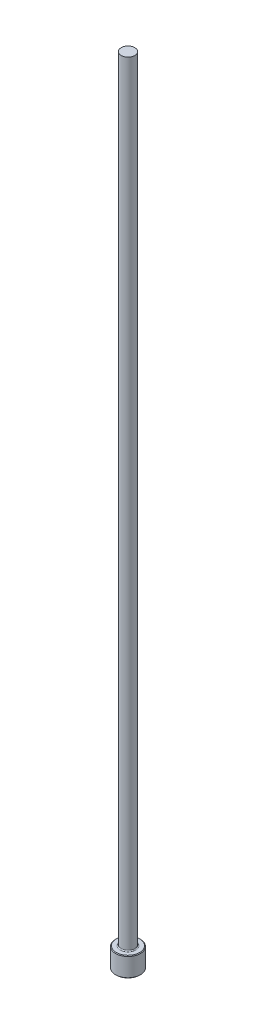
from build123d import *

# Parameters (mm, degrees)
CHAMFER1_SIZE = 0.0508
FILLET1_R     = 0.0762


with BuildPart() as part:
    # Sketch1 → Revolve1 (revolve)
    with BuildSketch(Plane.XY, mode=Mode.PRIVATE) as revolve1_sk:
        Polygon((0, 0), (-0.9906, 0), (-0.9906, 1.5748), (-0.5461, 1.5748), (-0.5461, 63.5), (0, 63.5), align=None)
    revolve(revolve1_sk.sketch.rotate(Axis((0, 259.958771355, 0), (0, -1, 0)), 270), axis=Axis((0, 259.958771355, 0), (0, -1, 0)))

    # Chamfer1
    chamfer1_edges = [part.edges().sort_by_distance(p)[0] for p in [
        (0, 1.5748, -0.9906),
        (0, 0, -0.9906),
    ]]
    chamfer(chamfer1_edges, length=CHAMFER1_SIZE)

    # Fillet1
    fillet1_edges = [part.edges().sort_by_distance(p)[0] for p in [
        (0, 1.5748, -0.5461),
    ]]
    fillet(fillet1_edges, radius=FILLET1_R)


solid = part.part
